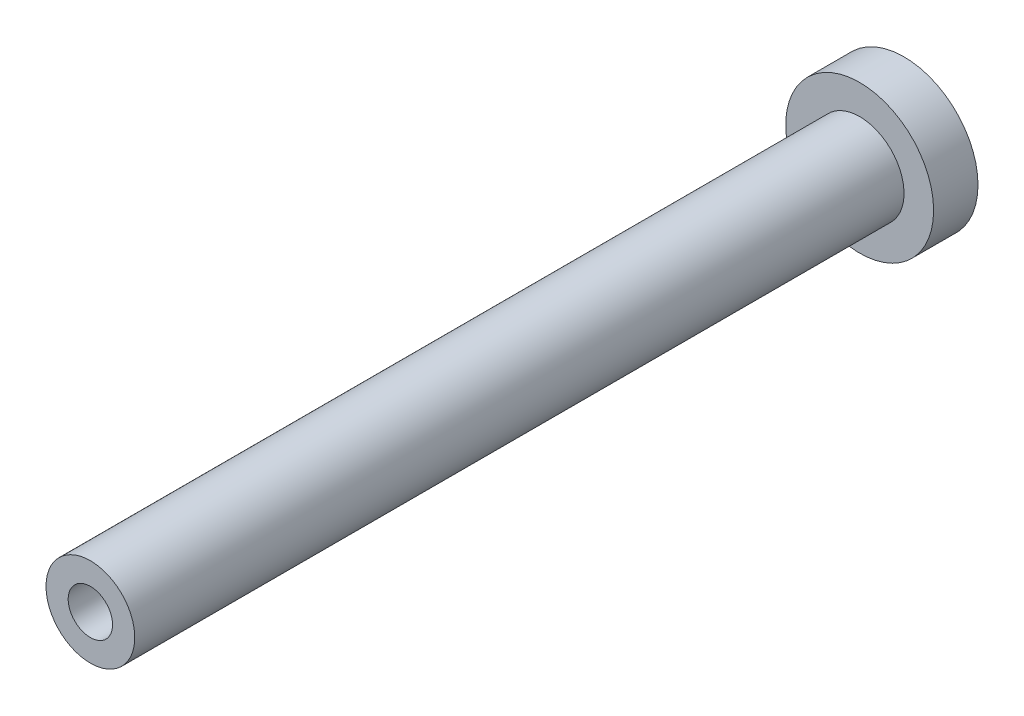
from build123d import *

# Parameters (mm, degrees)
SKETCH_1_R          = 5
EXTRUDE_1_DEPTH     = 3
SKETCH_2_R          = 3
EXTRUDE_2_DEPTH     = 52
SKETCH_3_R          = 1.5
CUT_EXTRUDE_1_DEPTH = 15


with BuildPart() as part:
    # Sketch 1 → Extrude 1 (new body)
    with BuildSketch(Plane.XY):
        Circle(SKETCH_1_R)
    extrude(amount=EXTRUDE_1_DEPTH)

    # Sketch 2 → Extrude 2 (add)
    with BuildSketch(Plane.XY.offset(3)):
        with Locations(Location((0, 0, 0), (0, 0, 180))):
            Circle(SKETCH_2_R)
    extrude(amount=EXTRUDE_2_DEPTH)

    # Sketch 3 → Cut-Extrude 1 (cut)
    with BuildSketch(Plane.XY.offset(55)):
        Circle(SKETCH_3_R)
    extrude(amount=-CUT_EXTRUDE_1_DEPTH, mode=Mode.SUBTRACT)


solid = part.part
